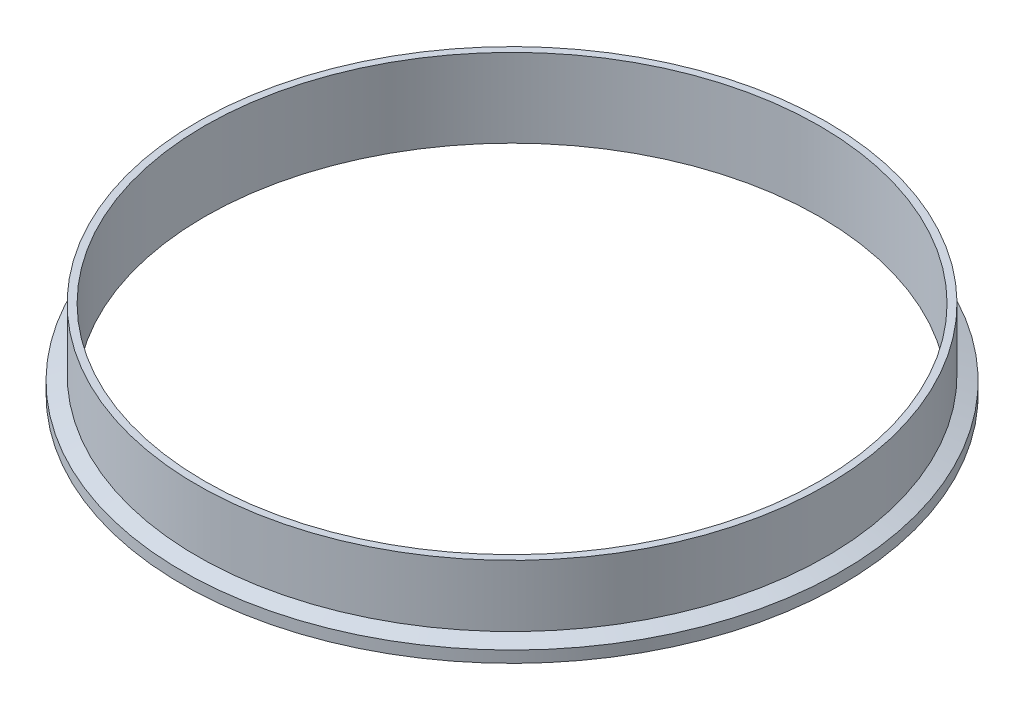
from build123d import *


with BuildPart() as part:
    # Sketch1 → Revolve2 (revolve)
    with BuildSketch(Plane.XY, mode=Mode.PRIVATE) as revolve2_sk:
        with BuildLine():
            Line((-148.9964, 0), (-148.9964, 38.1))
            Line((-148.9964, 38.1), (-152.4, 38.1))
            Line((-152.4, 38.1), (-152.4, 8.222780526))
            Line((-152.4, 8.222780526), (-159.639, 5.588))
            Line((-159.639, 5.588), (-159.639, 0))
            Line((-159.639, 0), (-156.199208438, 0))
            ThreePointArc((-156.199208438, 0), (-155.767011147, 0.129217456), (-155.476666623, 0.474458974))
            ThreePointArc((-155.476666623, 0.474458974), (-154.3812, 1.1938), (-153.285733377, 0.474458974))
            ThreePointArc((-153.285733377, 0.474458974), (-152.995388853, 0.129217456), (-152.563191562, 0))
            Line((-152.563191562, 0), (-148.9964, 0))
        make_face()
    revolve(revolve2_sk.sketch.rotate(Axis((0, 0, 0), (0, 1, 0)), 270), axis=Axis((0, 0, 0), (0, 1, 0)))


solid = part.part
